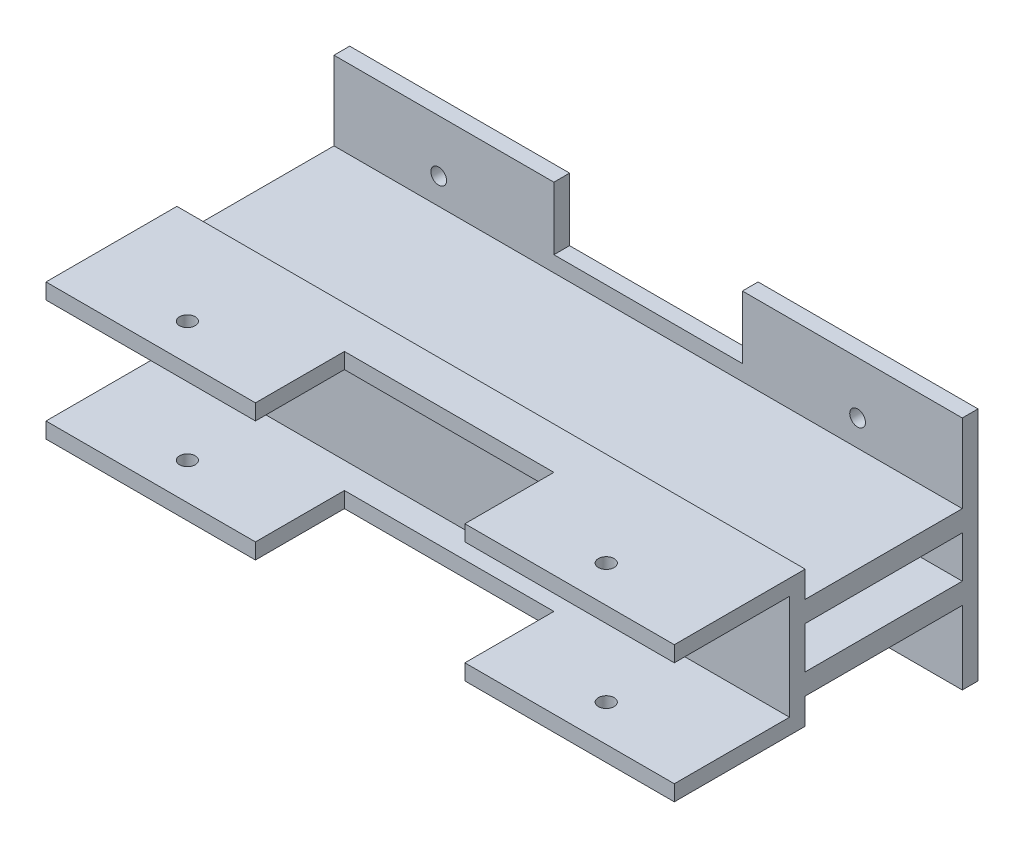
ISO-10303-21;
HEADER;
FILE_DESCRIPTION(('STEP AP214'),'2;1');
FILE_NAME('part.step','',(''),(''),'','','');
FILE_SCHEMA(('AUTOMOTIVE_DESIGN { 1 0 10303 214 1 1 1 1 }'));
ENDSEC;
DATA;
#1=APPLICATION_CONTEXT('core data for automotive mechanical design processes');
#2=APPLICATION_PROTOCOL_DEFINITION('international standard','automotive_design',2000,#1);
#3=PRODUCT_CONTEXT('',#1,'mechanical');
#4=PRODUCT('Part','Part','',(#3));
#5=PRODUCT_RELATED_PRODUCT_CATEGORY('part','',(#4));
#6=PRODUCT_DEFINITION_FORMATION('','',#4);
#7=PRODUCT_DEFINITION_CONTEXT('part definition',#1,'design');
#8=PRODUCT_DEFINITION('design','',#6,#7);
#9=PRODUCT_DEFINITION_SHAPE('','',#8);
#10=(LENGTH_UNIT() NAMED_UNIT(*) SI_UNIT(.MILLI.,.METRE.));
#11=(NAMED_UNIT(*) PLANE_ANGLE_UNIT() SI_UNIT($,.RADIAN.));
#12=(NAMED_UNIT(*) SI_UNIT($,.STERADIAN.) SOLID_ANGLE_UNIT());
#13=UNCERTAINTY_MEASURE_WITH_UNIT(LENGTH_MEASURE(1.E-05),#10,'distance_accuracy_value','');
#14=(GEOMETRIC_REPRESENTATION_CONTEXT(3) GLOBAL_UNCERTAINTY_ASSIGNED_CONTEXT((#13)) GLOBAL_UNIT_ASSIGNED_CONTEXT((#10,
#11,#12)) REPRESENTATION_CONTEXT('',''));
#15=CARTESIAN_POINT('',(0.,0.,0.));
#16=DIRECTION('',(0.,0.,1.));
#17=DIRECTION('',(1.,0.,0.));
#18=AXIS2_PLACEMENT_3D('',#15,#16,#17);
#19=CARTESIAN_POINT('',(-100.,3.,-12.5));
#20=DIRECTION('',(0.,0.,1.));
#21=DIRECTION('',(1.,0.,0.));
#22=AXIS2_PLACEMENT_3D('',#19,#20,#21);
#23=PLANE('',#22);
#24=DIRECTION('',(0.,1.,0.));
#25=VECTOR('',#24,1.);
#26=CARTESIAN_POINT('',(20.,3.,-12.5));
#27=LINE('',#26,#25);
#28=CARTESIAN_POINT('',(20.,-14.,-12.5));
#29=VERTEX_POINT('',#28);
#30=CARTESIAN_POINT('',(20.,-6.,-12.5));
#31=VERTEX_POINT('',#30);
#32=EDGE_CURVE('E656',#29,#31,#27,.T.);
#33=ORIENTED_EDGE('',*,*,#32,.F.);
#34=DIRECTION('',(1.,0.,0.));
#35=VECTOR('',#34,1.);
#36=CARTESIAN_POINT('',(100.,-14.,-12.5));
#37=LINE('',#36,#35);
#38=CARTESIAN_POINT('',(-100.,-14.,-12.5));
#39=VERTEX_POINT('',#38);
#40=EDGE_CURVE('E321',#39,#29,#37,.T.);
#41=ORIENTED_EDGE('',*,*,#40,.F.);
#42=DIRECTION('',(0.,-1.,0.));
#43=VECTOR('',#42,1.);
#44=CARTESIAN_POINT('',(-100.,3.,-12.5));
#45=LINE('',#44,#43);
#46=CARTESIAN_POINT('',(-100.,-6.,-12.5));
#47=VERTEX_POINT('',#46);
#48=EDGE_CURVE('E415',#47,#39,#45,.T.);
#49=ORIENTED_EDGE('',*,*,#48,.F.);
#50=DIRECTION('',(-1.,0.,0.));
#51=VECTOR('',#50,1.);
#52=CARTESIAN_POINT('',(100.,-6.,-12.5));
#53=LINE('',#52,#51);
#54=EDGE_CURVE('E333',#31,#47,#53,.T.);
#55=ORIENTED_EDGE('',*,*,#54,.F.);
#56=EDGE_LOOP('',(#33,#41,#49,#55));
#57=FACE_BOUND('',#56,.T.);
#58=ADVANCED_FACE('F41',(#57),#23,.F.);
#59=DIRECTION('',(0.,1.,0.));
#60=VECTOR('',#59,1.);
#61=CARTESIAN_POINT('',(20.,3.,-12.5));
#62=LINE('',#61,#60);
#63=CARTESIAN_POINT('',(20.,-23.,-12.5));
#64=VERTEX_POINT('',#63);
#65=CARTESIAN_POINT('',(20.,-18.,-12.5));
#66=VERTEX_POINT('',#65);
#67=EDGE_CURVE('E677',#64,#66,#62,.T.);
#68=ORIENTED_EDGE('',*,*,#67,.F.);
#69=DIRECTION('',(1.,0.,0.));
#70=VECTOR('',#69,1.);
#71=CARTESIAN_POINT('',(-100.,-23.,-12.5));
#72=LINE('',#71,#70);
#73=CARTESIAN_POINT('',(-100.,-23.,-12.5));
#74=VERTEX_POINT('',#73);
#75=EDGE_CURVE('E372',#74,#64,#72,.T.);
#76=ORIENTED_EDGE('',*,*,#75,.F.);
#77=CARTESIAN_POINT('',(-100.,-18.,-12.5));
#78=VERTEX_POINT('',#77);
#79=EDGE_CURVE('E410',#78,#74,#45,.T.);
#80=ORIENTED_EDGE('',*,*,#79,.F.);
#81=DIRECTION('',(-1.,0.,0.));
#82=VECTOR('',#81,1.);
#83=CARTESIAN_POINT('',(100.,-18.,-12.5));
#84=LINE('',#83,#82);
#85=EDGE_CURVE('E319',#66,#78,#84,.T.);
#86=ORIENTED_EDGE('',*,*,#85,.F.);
#87=EDGE_LOOP('',(#68,#76,#80,#86));
#88=FACE_BOUND('',#87,.T.);
#89=ADVANCED_FACE('F598',(#88),#23,.F.);
#90=DIRECTION('',(0.,1.,0.));
#91=VECTOR('',#90,1.);
#92=CARTESIAN_POINT('',(20.,3.,-12.5));
#93=LINE('',#92,#91);
#94=CARTESIAN_POINT('',(20.,-2.,-12.5));
#95=VERTEX_POINT('',#94);
#96=CARTESIAN_POINT('',(20.,3.,-12.5));
#97=VERTEX_POINT('',#96);
#98=EDGE_CURVE('E619',#95,#97,#93,.T.);
#99=ORIENTED_EDGE('',*,*,#98,.F.);
#100=DIRECTION('',(1.,0.,0.));
#101=VECTOR('',#100,1.);
#102=CARTESIAN_POINT('',(100.,-2.,-12.5));
#103=LINE('',#102,#101);
#104=CARTESIAN_POINT('',(-100.,-2.,-12.5));
#105=VERTEX_POINT('',#104);
#106=EDGE_CURVE('E325',#105,#95,#103,.T.);
#107=ORIENTED_EDGE('',*,*,#106,.F.);
#108=CARTESIAN_POINT('',(-100.,3.,-12.5));
#109=VERTEX_POINT('',#108);
#110=EDGE_CURVE('E411',#109,#105,#45,.T.);
#111=ORIENTED_EDGE('',*,*,#110,.F.);
#112=DIRECTION('',(-1.,0.,0.));
#113=VECTOR('',#112,1.);
#114=CARTESIAN_POINT('',(-100.,3.,-12.5));
#115=LINE('',#114,#113);
#116=EDGE_CURVE('E394',#97,#109,#115,.T.);
#117=ORIENTED_EDGE('',*,*,#116,.F.);
#118=EDGE_LOOP('',(#99,#107,#111,#117));
#119=FACE_BOUND('',#118,.T.);
#120=ADVANCED_FACE('F600',(#119),#23,.F.);
#121=CARTESIAN_POINT('',(0.,3.,0.));
#122=DIRECTION('',(0.,-1.,0.));
#123=DIRECTION('',(0.,0.,-1.));
#124=AXIS2_PLACEMENT_3D('',#121,#122,#123);
#125=PLANE('',#124);
#126=CARTESIAN_POINT('',(0.,3.,5.5));
#127=DIRECTION('',(0.,1.,0.));
#128=DIRECTION('',(0.,0.,1.));
#129=AXIS2_PLACEMENT_3D('',#126,#127,#128);
#130=CIRCLE('',#129,1.5);
#131=CARTESIAN_POINT('',(0.,3.,7.));
#132=VERTEX_POINT('',#131);
#133=EDGE_CURVE('E349',#132,#132,#130,.T.);
#134=ORIENTED_EDGE('',*,*,#133,.F.);
#135=EDGE_LOOP('',(#134));
#136=FACE_BOUND('',#135,.T.);
#137=CARTESIAN_POINT('',(-80.,3.,5.5));
#138=DIRECTION('',(0.,1.,0.));
#139=DIRECTION('',(0.,0.,1.));
#140=AXIS2_PLACEMENT_3D('',#137,#138,#139);
#141=CIRCLE('',#140,1.5);
#142=CARTESIAN_POINT('',(-80.,3.,7.));
#143=VERTEX_POINT('',#142);
#144=EDGE_CURVE('E345',#143,#143,#141,.T.);
#145=ORIENTED_EDGE('',*,*,#144,.F.);
#146=EDGE_LOOP('',(#145));
#147=FACE_BOUND('',#146,.T.);
#148=DIRECTION('',(0.,0.,1.));
#149=VECTOR('',#148,1.);
#150=CARTESIAN_POINT('',(20.,3.,-4.5));
#151=LINE('',#150,#149);
#152=CARTESIAN_POINT('',(20.,3.,12.5));
#153=VERTEX_POINT('',#152);
#154=EDGE_CURVE('E514',#97,#153,#151,.T.);
#155=ORIENTED_EDGE('',*,*,#154,.F.);
#156=ORIENTED_EDGE('',*,*,#116,.T.);
#157=DIRECTION('',(0.,0.,1.));
#158=VECTOR('',#157,1.);
#159=CARTESIAN_POINT('',(-100.,3.,12.5));
#160=LINE('',#159,#158);
#161=CARTESIAN_POINT('',(-100.,3.,12.5));
#162=VERTEX_POINT('',#161);
#163=EDGE_CURVE('E396',#109,#162,#160,.T.);
#164=ORIENTED_EDGE('',*,*,#163,.T.);
#165=DIRECTION('',(1.,0.,0.));
#166=VECTOR('',#165,1.);
#167=CARTESIAN_POINT('',(-100.,3.,12.5));
#168=LINE('',#167,#166);
#169=CARTESIAN_POINT('',(-60.,3.,12.5));
#170=VERTEX_POINT('',#169);
#171=EDGE_CURVE('E400',#162,#170,#168,.T.);
#172=ORIENTED_EDGE('',*,*,#171,.T.);
#173=DIRECTION('',(0.,0.,1.));
#174=VECTOR('',#173,1.);
#175=CARTESIAN_POINT('',(-60.,3.,-4.5));
#176=LINE('',#175,#174);
#177=CARTESIAN_POINT('',(-60.,3.,-4.5));
#178=VERTEX_POINT('',#177);
#179=EDGE_CURVE('E505',#178,#170,#176,.T.);
#180=ORIENTED_EDGE('',*,*,#179,.F.);
#181=DIRECTION('',(-1.,0.,0.));
#182=VECTOR('',#181,1.);
#183=CARTESIAN_POINT('',(-60.,3.,-4.5));
#184=LINE('',#183,#182);
#185=CARTESIAN_POINT('',(-20.,3.,-4.5));
#186=VERTEX_POINT('',#185);
#187=EDGE_CURVE('E508',#186,#178,#184,.T.);
#188=ORIENTED_EDGE('',*,*,#187,.F.);
#189=DIRECTION('',(0.,0.,-1.));
#190=VECTOR('',#189,1.);
#191=CARTESIAN_POINT('',(-20.,3.,-4.5));
#192=LINE('',#191,#190);
#193=CARTESIAN_POINT('',(-20.,3.,12.5));
#194=VERTEX_POINT('',#193);
#195=EDGE_CURVE('E511',#194,#186,#192,.T.);
#196=ORIENTED_EDGE('',*,*,#195,.F.);
#197=EDGE_CURVE('E399',#194,#153,#168,.T.);
#198=ORIENTED_EDGE('',*,*,#197,.T.);
#199=EDGE_LOOP('',(#155,#156,#164,#172,#180,#188,#196,#198));
#200=FACE_BOUND('',#199,.T.);
#201=ADVANCED_FACE('F608',(#136,#147,#200),#125,.F.);
#202=CARTESIAN_POINT('',(0.,0.,0.));
#203=DIRECTION('',(0.,-1.,0.));
#204=DIRECTION('',(0.,0.,-1.));
#205=AXIS2_PLACEMENT_3D('',#202,#203,#204);
#206=PLANE('',#205);
#207=CARTESIAN_POINT('',(0.,0.,5.5));
#208=DIRECTION('',(0.,-1.,0.));
#209=DIRECTION('',(0.,0.,-1.));
#210=AXIS2_PLACEMENT_3D('',#207,#208,#209);
#211=CIRCLE('',#210,1.5);
#212=CARTESIAN_POINT('',(0.,0.,4.));
#213=VERTEX_POINT('',#212);
#214=EDGE_CURVE('E359',#213,#213,#211,.T.);
#215=ORIENTED_EDGE('',*,*,#214,.F.);
#216=EDGE_LOOP('',(#215));
#217=FACE_BOUND('',#216,.T.);
#218=CARTESIAN_POINT('',(-80.,0.,5.5));
#219=DIRECTION('',(0.,-1.,0.));
#220=DIRECTION('',(0.,0.,-1.));
#221=AXIS2_PLACEMENT_3D('',#218,#219,#220);
#222=CIRCLE('',#221,1.5);
#223=CARTESIAN_POINT('',(-80.,0.,4.));
#224=VERTEX_POINT('',#223);
#225=EDGE_CURVE('E365',#224,#224,#222,.T.);
#226=ORIENTED_EDGE('',*,*,#225,.F.);
#227=EDGE_LOOP('',(#226));
#228=FACE_BOUND('',#227,.T.);
#229=DIRECTION('',(-1.,0.,0.));
#230=VECTOR('',#229,1.);
#231=CARTESIAN_POINT('',(-100.,0.,-9.5));
#232=LINE('',#231,#230);
#233=CARTESIAN_POINT('',(20.,0.,-9.5));
#234=VERTEX_POINT('',#233);
#235=CARTESIAN_POINT('',(-100.,0.,-9.5));
#236=VERTEX_POINT('',#235);
#237=EDGE_CURVE('E386',#234,#236,#232,.T.);
#238=ORIENTED_EDGE('',*,*,#237,.F.);
#239=DIRECTION('',(0.,0.,-1.));
#240=VECTOR('',#239,1.);
#241=CARTESIAN_POINT('',(20.,0.,0.));
#242=LINE('',#241,#240);
#243=CARTESIAN_POINT('',(20.,0.,12.5));
#244=VERTEX_POINT('',#243);
#245=EDGE_CURVE('E547',#244,#234,#242,.T.);
#246=ORIENTED_EDGE('',*,*,#245,.F.);
#247=DIRECTION('',(1.,0.,0.));
#248=VECTOR('',#247,1.);
#249=CARTESIAN_POINT('',(-100.,0.,12.5));
#250=LINE('',#249,#248);
#251=CARTESIAN_POINT('',(-20.,0.,12.5));
#252=VERTEX_POINT('',#251);
#253=EDGE_CURVE('E405',#252,#244,#250,.T.);
#254=ORIENTED_EDGE('',*,*,#253,.F.);
#255=DIRECTION('',(0.,0.,1.));
#256=VECTOR('',#255,1.);
#257=CARTESIAN_POINT('',(-20.,0.,0.));
#258=LINE('',#257,#256);
#259=CARTESIAN_POINT('',(-20.,0.,-4.5));
#260=VERTEX_POINT('',#259);
#261=EDGE_CURVE('E562',#260,#252,#258,.T.);
#262=ORIENTED_EDGE('',*,*,#261,.F.);
#263=DIRECTION('',(1.,0.,0.));
#264=VECTOR('',#263,1.);
#265=CARTESIAN_POINT('',(0.,0.,-4.5));
#266=LINE('',#265,#264);
#267=CARTESIAN_POINT('',(-60.,0.,-4.5));
#268=VERTEX_POINT('',#267);
#269=EDGE_CURVE('E557',#268,#260,#266,.T.);
#270=ORIENTED_EDGE('',*,*,#269,.F.);
#271=DIRECTION('',(0.,0.,-1.));
#272=VECTOR('',#271,1.);
#273=CARTESIAN_POINT('',(-60.,0.,0.));
#274=LINE('',#273,#272);
#275=CARTESIAN_POINT('',(-60.,0.,12.5));
#276=VERTEX_POINT('',#275);
#277=EDGE_CURVE('E552',#276,#268,#274,.T.);
#278=ORIENTED_EDGE('',*,*,#277,.F.);
#279=CARTESIAN_POINT('',(-100.,0.,12.5));
#280=VERTEX_POINT('',#279);
#281=EDGE_CURVE('E397',#280,#276,#250,.T.);
#282=ORIENTED_EDGE('',*,*,#281,.F.);
#283=DIRECTION('',(0.,0.,1.));
#284=VECTOR('',#283,1.);
#285=CARTESIAN_POINT('',(-100.,0.,12.5));
#286=LINE('',#285,#284);
#287=EDGE_CURVE('E393',#236,#280,#286,.T.);
#288=ORIENTED_EDGE('',*,*,#287,.F.);
#289=EDGE_LOOP('',(#238,#246,#254,#262,#270,#278,#282,#288));
#290=FACE_BOUND('',#289,.T.);
#291=ADVANCED_FACE('F613',(#217,#228,#290),#206,.T.);
#292=CARTESIAN_POINT('',(-100.,-20.,-9.5));
#293=DIRECTION('',(0.,0.,-1.));
#294=DIRECTION('',(-1.,0.,0.));
#295=AXIS2_PLACEMENT_3D('',#292,#293,#294);
#296=PLANE('',#295);
#297=DIRECTION('',(0.,-1.,0.));
#298=VECTOR('',#297,1.);
#299=CARTESIAN_POINT('',(20.,-20.,-9.5));
#300=LINE('',#299,#298);
#301=CARTESIAN_POINT('',(20.,-20.,-9.5));
#302=VERTEX_POINT('',#301);
#303=EDGE_CURVE('E650',#234,#302,#300,.T.);
#304=ORIENTED_EDGE('',*,*,#303,.F.);
#305=ORIENTED_EDGE('',*,*,#237,.T.);
#306=DIRECTION('',(0.,1.,0.));
#307=VECTOR('',#306,1.);
#308=CARTESIAN_POINT('',(-100.,-20.,-9.5));
#309=LINE('',#308,#307);
#310=CARTESIAN_POINT('',(-100.,-20.,-9.5));
#311=VERTEX_POINT('',#310);
#312=EDGE_CURVE('E389',#311,#236,#309,.T.);
#313=ORIENTED_EDGE('',*,*,#312,.F.);
#314=DIRECTION('',(-1.,0.,0.));
#315=VECTOR('',#314,1.);
#316=CARTESIAN_POINT('',(-100.,-20.,-9.5));
#317=LINE('',#316,#315);
#318=EDGE_CURVE('E387',#302,#311,#317,.T.);
#319=ORIENTED_EDGE('',*,*,#318,.F.);
#320=EDGE_LOOP('',(#304,#305,#313,#319));
#321=FACE_BOUND('',#320,.T.);
#322=ADVANCED_FACE('F653',(#321),#296,.F.);
#323=CARTESIAN_POINT('',(0.,-20.,0.));
#324=DIRECTION('',(0.,-1.,0.));
#325=DIRECTION('',(0.,0.,-1.));
#326=AXIS2_PLACEMENT_3D('',#323,#324,#325);
#327=PLANE('',#326);
#328=CARTESIAN_POINT('',(0.,-20.,5.5));
#329=DIRECTION('',(0.,-1.,0.));
#330=DIRECTION('',(0.,0.,-1.));
#331=AXIS2_PLACEMENT_3D('',#328,#329,#330);
#332=CIRCLE('',#331,1.5);
#333=CARTESIAN_POINT('',(0.,-20.,4.));
#334=VERTEX_POINT('',#333);
#335=EDGE_CURVE('E352',#334,#334,#332,.T.);
#336=ORIENTED_EDGE('',*,*,#335,.T.);
#337=EDGE_LOOP('',(#336));
#338=FACE_BOUND('',#337,.T.);
#339=CARTESIAN_POINT('',(-80.,-20.,5.5));
#340=DIRECTION('',(0.,-1.,0.));
#341=DIRECTION('',(0.,0.,-1.));
#342=AXIS2_PLACEMENT_3D('',#339,#340,#341);
#343=CIRCLE('',#342,1.5);
#344=CARTESIAN_POINT('',(-80.,-20.,4.));
#345=VERTEX_POINT('',#344);
#346=EDGE_CURVE('E362',#345,#345,#343,.T.);
#347=ORIENTED_EDGE('',*,*,#346,.T.);
#348=EDGE_LOOP('',(#347));
#349=FACE_BOUND('',#348,.T.);
#350=DIRECTION('',(0.,0.,-1.));
#351=VECTOR('',#350,1.);
#352=CARTESIAN_POINT('',(20.,-20.,0.));
#353=LINE('',#352,#351);
#354=CARTESIAN_POINT('',(20.,-20.,12.5));
#355=VERTEX_POINT('',#354);
#356=EDGE_CURVE('E538',#355,#302,#353,.T.);
#357=ORIENTED_EDGE('',*,*,#356,.T.);
#358=ORIENTED_EDGE('',*,*,#318,.T.);
#359=DIRECTION('',(0.,0.,-1.));
#360=VECTOR('',#359,1.);
#361=CARTESIAN_POINT('',(-100.,-20.,12.5));
#362=LINE('',#361,#360);
#363=CARTESIAN_POINT('',(-100.,-20.,12.5));
#364=VERTEX_POINT('',#363);
#365=EDGE_CURVE('E368',#364,#311,#362,.T.);
#366=ORIENTED_EDGE('',*,*,#365,.F.);
#367=DIRECTION('',(-1.,0.,0.));
#368=VECTOR('',#367,1.);
#369=CARTESIAN_POINT('',(-100.,-20.,12.5));
#370=LINE('',#369,#368);
#371=CARTESIAN_POINT('',(-60.,-20.,12.5));
#372=VERTEX_POINT('',#371);
#373=EDGE_CURVE('E381',#372,#364,#370,.T.);
#374=ORIENTED_EDGE('',*,*,#373,.F.);
#375=DIRECTION('',(0.,0.,-1.));
#376=VECTOR('',#375,1.);
#377=CARTESIAN_POINT('',(-60.,-20.,0.));
#378=LINE('',#377,#376);
#379=CARTESIAN_POINT('',(-60.,-20.,-4.5));
#380=VERTEX_POINT('',#379);
#381=EDGE_CURVE('E549',#372,#380,#378,.T.);
#382=ORIENTED_EDGE('',*,*,#381,.T.);
#383=DIRECTION('',(1.,0.,0.));
#384=VECTOR('',#383,1.);
#385=CARTESIAN_POINT('',(0.,-20.,-4.5));
#386=LINE('',#385,#384);
#387=CARTESIAN_POINT('',(-20.,-20.,-4.5));
#388=VERTEX_POINT('',#387);
#389=EDGE_CURVE('E554',#380,#388,#386,.T.);
#390=ORIENTED_EDGE('',*,*,#389,.T.);
#391=DIRECTION('',(0.,0.,1.));
#392=VECTOR('',#391,1.);
#393=CARTESIAN_POINT('',(-20.,-20.,0.));
#394=LINE('',#393,#392);
#395=CARTESIAN_POINT('',(-20.,-20.,12.5));
#396=VERTEX_POINT('',#395);
#397=EDGE_CURVE('E559',#388,#396,#394,.T.);
#398=ORIENTED_EDGE('',*,*,#397,.T.);
#399=EDGE_CURVE('E373',#355,#396,#370,.T.);
#400=ORIENTED_EDGE('',*,*,#399,.F.);
#401=EDGE_LOOP('',(#357,#358,#366,#374,#382,#390,#398,#400));
#402=FACE_BOUND('',#401,.T.);
#403=ADVANCED_FACE('F710',(#338,#349,#402),#327,.F.);
#404=CARTESIAN_POINT('',(0.,-23.,0.));
#405=DIRECTION('',(0.,-1.,0.));
#406=DIRECTION('',(0.,0.,-1.));
#407=AXIS2_PLACEMENT_3D('',#404,#405,#406);
#408=PLANE('',#407);
#409=CARTESIAN_POINT('',(0.,-23.,5.5));
#410=DIRECTION('',(0.,-1.,0.));
#411=DIRECTION('',(0.,0.,-1.));
#412=AXIS2_PLACEMENT_3D('',#409,#410,#411);
#413=CIRCLE('',#412,1.5);
#414=CARTESIAN_POINT('',(0.,-23.,4.));
#415=VERTEX_POINT('',#414);
#416=EDGE_CURVE('E344',#415,#415,#413,.F.);
#417=ORIENTED_EDGE('',*,*,#416,.T.);
#418=EDGE_LOOP('',(#417));
#419=FACE_BOUND('',#418,.T.);
#420=CARTESIAN_POINT('',(-80.,-23.,5.5));
#421=DIRECTION('',(0.,-1.,0.));
#422=DIRECTION('',(0.,0.,-1.));
#423=AXIS2_PLACEMENT_3D('',#420,#421,#422);
#424=CIRCLE('',#423,1.5);
#425=CARTESIAN_POINT('',(-80.,-23.,4.));
#426=VERTEX_POINT('',#425);
#427=EDGE_CURVE('E348',#426,#426,#424,.F.);
#428=ORIENTED_EDGE('',*,*,#427,.T.);
#429=EDGE_LOOP('',(#428));
#430=FACE_BOUND('',#429,.T.);
#431=ORIENTED_EDGE('',*,*,#75,.T.);
#432=DIRECTION('',(0.,0.,1.));
#433=VECTOR('',#432,1.);
#434=CARTESIAN_POINT('',(20.,-23.,-4.5));
#435=LINE('',#434,#433);
#436=CARTESIAN_POINT('',(20.,-23.,12.5));
#437=VERTEX_POINT('',#436);
#438=EDGE_CURVE('E542',#64,#437,#435,.T.);
#439=ORIENTED_EDGE('',*,*,#438,.T.);
#440=DIRECTION('',(-1.,0.,0.));
#441=VECTOR('',#440,1.);
#442=CARTESIAN_POINT('',(-100.,-23.,12.5));
#443=LINE('',#442,#441);
#444=CARTESIAN_POINT('',(-20.,-23.,12.5));
#445=VERTEX_POINT('',#444);
#446=EDGE_CURVE('E378',#437,#445,#443,.T.);
#447=ORIENTED_EDGE('',*,*,#446,.T.);
#448=DIRECTION('',(0.,0.,-1.));
#449=VECTOR('',#448,1.);
#450=CARTESIAN_POINT('',(-20.,-23.,-4.5));
#451=LINE('',#450,#449);
#452=CARTESIAN_POINT('',(-20.,-23.,-4.5));
#453=VERTEX_POINT('',#452);
#454=EDGE_CURVE('E507',#445,#453,#451,.T.);
#455=ORIENTED_EDGE('',*,*,#454,.T.);
#456=DIRECTION('',(-1.,0.,0.));
#457=VECTOR('',#456,1.);
#458=CARTESIAN_POINT('',(-60.,-23.,-4.5));
#459=LINE('',#458,#457);
#460=CARTESIAN_POINT('',(-60.,-23.,-4.5));
#461=VERTEX_POINT('',#460);
#462=EDGE_CURVE('E523',#453,#461,#459,.T.);
#463=ORIENTED_EDGE('',*,*,#462,.T.);
#464=DIRECTION('',(0.,0.,1.));
#465=VECTOR('',#464,1.);
#466=CARTESIAN_POINT('',(-60.,-23.,-4.5));
#467=LINE('',#466,#465);
#468=CARTESIAN_POINT('',(-60.,-23.,12.5));
#469=VERTEX_POINT('',#468);
#470=EDGE_CURVE('E518',#461,#469,#467,.T.);
#471=ORIENTED_EDGE('',*,*,#470,.T.);
#472=CARTESIAN_POINT('',(-100.,-23.,12.5));
#473=VERTEX_POINT('',#472);
#474=EDGE_CURVE('E376',#469,#473,#443,.T.);
#475=ORIENTED_EDGE('',*,*,#474,.T.);
#476=DIRECTION('',(0.,0.,-1.));
#477=VECTOR('',#476,1.);
#478=CARTESIAN_POINT('',(-100.,-23.,12.5));
#479=LINE('',#478,#477);
#480=EDGE_CURVE('E369',#473,#74,#479,.T.);
#481=ORIENTED_EDGE('',*,*,#480,.T.);
#482=EDGE_LOOP('',(#431,#439,#447,#455,#463,#471,#475,#481));
#483=FACE_BOUND('',#482,.T.);
#484=ADVANCED_FACE('F702',(#419,#430,#483),#408,.T.);
#485=CARTESIAN_POINT('',(100.,-2.,-42.5));
#486=DIRECTION('',(0.,-1.,0.));
#487=DIRECTION('',(0.,0.,-1.));
#488=AXIS2_PLACEMENT_3D('',#485,#486,#487);
#489=PLANE('',#488);
#490=DIRECTION('',(0.,0.,1.));
#491=VECTOR('',#490,1.);
#492=CARTESIAN_POINT('',(20.,-2.,-42.5));
#493=LINE('',#492,#491);
#494=CARTESIAN_POINT('',(20.,-2.00000000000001,-42.5));
#495=VERTEX_POINT('',#494);
#496=EDGE_CURVE('E622',#495,#95,#493,.T.);
#497=ORIENTED_EDGE('',*,*,#496,.F.);
#498=DIRECTION('',(1.,0.,0.));
#499=VECTOR('',#498,1.);
#500=CARTESIAN_POINT('',(100.,-2.,-42.5));
#501=LINE('',#500,#499);
#502=CARTESIAN_POINT('',(-100.,-2.,-42.5));
#503=VERTEX_POINT('',#502);
#504=EDGE_CURVE('E329',#503,#495,#501,.T.);
#505=ORIENTED_EDGE('',*,*,#504,.F.);
#506=DIRECTION('',(0.,0.,1.));
#507=VECTOR('',#506,1.);
#508=CARTESIAN_POINT('',(-100.,-2.,-42.5));
#509=LINE('',#508,#507);
#510=EDGE_CURVE('E335',#503,#105,#509,.T.);
#511=ORIENTED_EDGE('',*,*,#510,.T.);
#512=ORIENTED_EDGE('',*,*,#106,.T.);
#513=EDGE_LOOP('',(#497,#505,#511,#512));
#514=FACE_BOUND('',#513,.T.);
#515=ADVANCED_FACE('F626',(#514),#489,.F.);
#516=CARTESIAN_POINT('',(100.,-6.,-42.5));
#517=DIRECTION('',(0.,1.,0.));
#518=DIRECTION('',(0.,0.,1.));
#519=AXIS2_PLACEMENT_3D('',#516,#517,#518);
#520=PLANE('',#519);
#521=DIRECTION('',(0.,0.,-1.));
#522=VECTOR('',#521,1.);
#523=CARTESIAN_POINT('',(20.,-6.,-42.5));
#524=LINE('',#523,#522);
#525=CARTESIAN_POINT('',(20.,-6.,-42.5));
#526=VERTEX_POINT('',#525);
#527=EDGE_CURVE('E55',#31,#526,#524,.T.);
#528=ORIENTED_EDGE('',*,*,#527,.F.);
#529=ORIENTED_EDGE('',*,*,#54,.T.);
#530=DIRECTION('',(0.,0.,1.));
#531=VECTOR('',#530,1.);
#532=CARTESIAN_POINT('',(-100.,-6.,-42.5));
#533=LINE('',#532,#531);
#534=CARTESIAN_POINT('',(-100.,-6.,-42.5));
#535=VERTEX_POINT('',#534);
#536=EDGE_CURVE('E341',#535,#47,#533,.T.);
#537=ORIENTED_EDGE('',*,*,#536,.F.);
#538=DIRECTION('',(-1.,0.,0.));
#539=VECTOR('',#538,1.);
#540=CARTESIAN_POINT('',(100.,-6.,-42.5));
#541=LINE('',#540,#539);
#542=EDGE_CURVE('E332',#526,#535,#541,.T.);
#543=ORIENTED_EDGE('',*,*,#542,.F.);
#544=EDGE_LOOP('',(#528,#529,#537,#543));
#545=FACE_BOUND('',#544,.T.);
#546=ADVANCED_FACE('F776',(#545),#520,.F.);
#547=CARTESIAN_POINT('',(100.,-14.,-42.5));
#548=DIRECTION('',(0.,-1.,0.));
#549=DIRECTION('',(0.,0.,-1.));
#550=AXIS2_PLACEMENT_3D('',#547,#548,#549);
#551=PLANE('',#550);
#552=DIRECTION('',(0.,0.,1.));
#553=VECTOR('',#552,1.);
#554=CARTESIAN_POINT('',(20.,-14.,-42.5));
#555=LINE('',#554,#553);
#556=CARTESIAN_POINT('',(20.,-14.,-42.5));
#557=VERTEX_POINT('',#556);
#558=EDGE_CURVE('E684',#557,#29,#555,.T.);
#559=ORIENTED_EDGE('',*,*,#558,.F.);
#560=DIRECTION('',(1.,0.,0.));
#561=VECTOR('',#560,1.);
#562=CARTESIAN_POINT('',(100.,-14.,-42.5));
#563=LINE('',#562,#561);
#564=CARTESIAN_POINT('',(-100.,-14.,-42.5));
#565=VERTEX_POINT('',#564);
#566=EDGE_CURVE('E322',#565,#557,#563,.T.);
#567=ORIENTED_EDGE('',*,*,#566,.F.);
#568=DIRECTION('',(0.,0.,1.));
#569=VECTOR('',#568,1.);
#570=CARTESIAN_POINT('',(-100.,-14.,-42.5));
#571=LINE('',#570,#569);
#572=EDGE_CURVE('E316',#565,#39,#571,.T.);
#573=ORIENTED_EDGE('',*,*,#572,.T.);
#574=ORIENTED_EDGE('',*,*,#40,.T.);
#575=EDGE_LOOP('',(#559,#567,#573,#574));
#576=FACE_BOUND('',#575,.T.);
#577=ADVANCED_FACE('F692',(#576),#551,.F.);
#578=CARTESIAN_POINT('',(100.,-18.,-42.5));
#579=DIRECTION('',(0.,1.,0.));
#580=DIRECTION('',(0.,0.,1.));
#581=AXIS2_PLACEMENT_3D('',#578,#579,#580);
#582=PLANE('',#581);
#583=DIRECTION('',(0.,0.,-1.));
#584=VECTOR('',#583,1.);
#585=CARTESIAN_POINT('',(20.,-18.,-42.5));
#586=LINE('',#585,#584);
#587=CARTESIAN_POINT('',(20.,-18.,-42.5));
#588=VERTEX_POINT('',#587);
#589=EDGE_CURVE('E279',#66,#588,#586,.T.);
#590=ORIENTED_EDGE('',*,*,#589,.F.);
#591=ORIENTED_EDGE('',*,*,#85,.T.);
#592=DIRECTION('',(0.,0.,1.));
#593=VECTOR('',#592,1.);
#594=CARTESIAN_POINT('',(-100.,-18.,-42.5));
#595=LINE('',#594,#593);
#596=CARTESIAN_POINT('',(-100.,-18.,-42.5));
#597=VERTEX_POINT('',#596);
#598=EDGE_CURVE('E313',#597,#78,#595,.T.);
#599=ORIENTED_EDGE('',*,*,#598,.F.);
#600=DIRECTION('',(-1.,0.,0.));
#601=VECTOR('',#600,1.);
#602=CARTESIAN_POINT('',(100.,-18.,-42.5));
#603=LINE('',#602,#601);
#604=EDGE_CURVE('E318',#588,#597,#603,.T.);
#605=ORIENTED_EDGE('',*,*,#604,.F.);
#606=EDGE_LOOP('',(#590,#591,#599,#605));
#607=FACE_BOUND('',#606,.T.);
#608=ADVANCED_FACE('F761',(#607),#582,.F.);
#609=CARTESIAN_POINT('',(0.,0.,-42.5));
#610=DIRECTION('',(0.,0.,1.));
#611=DIRECTION('',(1.,0.,0.));
#612=AXIS2_PLACEMENT_3D('',#609,#610,#611);
#613=PLANE('',#612);
#614=CARTESIAN_POINT('',(0.,3.,-42.5));
#615=DIRECTION('',(0.,0.,-1.));
#616=DIRECTION('',(-1.,0.,0.));
#617=AXIS2_PLACEMENT_3D('',#614,#615,#616);
#618=CIRCLE('',#617,1.5);
#619=CARTESIAN_POINT('',(-1.50000000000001,3.,-42.5));
#620=VERTEX_POINT('',#619);
#621=EDGE_CURVE('E448',#620,#620,#618,.T.);
#622=ORIENTED_EDGE('',*,*,#621,.T.);
#623=EDGE_LOOP('',(#622));
#624=FACE_BOUND('',#623,.T.);
#625=CARTESIAN_POINT('',(-80.,3.,-42.5));
#626=DIRECTION('',(0.,0.,-1.));
#627=DIRECTION('',(-1.,0.,0.));
#628=AXIS2_PLACEMENT_3D('',#625,#626,#627);
#629=CIRCLE('',#628,1.5);
#630=CARTESIAN_POINT('',(-81.5,3.,-42.5));
#631=VERTEX_POINT('',#630);
#632=EDGE_CURVE('E568',#631,#631,#629,.T.);
#633=ORIENTED_EDGE('',*,*,#632,.T.);
#634=EDGE_LOOP('',(#633));
#635=FACE_BOUND('',#634,.T.);
#636=ORIENTED_EDGE('',*,*,#504,.T.);
#637=DIRECTION('',(0.,1.,0.));
#638=VECTOR('',#637,1.);
#639=CARTESIAN_POINT('',(20.,0.,-42.5));
#640=LINE('',#639,#638);
#641=CARTESIAN_POINT('',(20.,13.,-42.5));
#642=VERTEX_POINT('',#641);
#643=EDGE_CURVE('E433',#495,#642,#640,.T.);
#644=ORIENTED_EDGE('',*,*,#643,.T.);
#645=DIRECTION('',(1.,0.,0.));
#646=VECTOR('',#645,1.);
#647=CARTESIAN_POINT('',(100.,13.,-42.5));
#648=LINE('',#647,#646);
#649=CARTESIAN_POINT('',(-22.,13.,-42.5));
#650=VERTEX_POINT('',#649);
#651=EDGE_CURVE('E425',#650,#642,#648,.T.);
#652=ORIENTED_EDGE('',*,*,#651,.F.);
#653=DIRECTION('',(0.,1.,0.));
#654=VECTOR('',#653,1.);
#655=CARTESIAN_POINT('',(-22.,0.,-42.5));
#656=LINE('',#655,#654);
#657=CARTESIAN_POINT('',(-22.,1.,-42.5));
#658=VERTEX_POINT('',#657);
#659=EDGE_CURVE('E63',#658,#650,#656,.T.);
#660=ORIENTED_EDGE('',*,*,#659,.F.);
#661=DIRECTION('',(1.,0.,0.));
#662=VECTOR('',#661,1.);
#663=CARTESIAN_POINT('',(0.,1.,-42.5));
#664=LINE('',#663,#662);
#665=CARTESIAN_POINT('',(-58.,1.,-42.5));
#666=VERTEX_POINT('',#665);
#667=EDGE_CURVE('E500',#666,#658,#664,.T.);
#668=ORIENTED_EDGE('',*,*,#667,.F.);
#669=DIRECTION('',(0.,-1.,0.));
#670=VECTOR('',#669,1.);
#671=CARTESIAN_POINT('',(-58.,0.,-42.5));
#672=LINE('',#671,#670);
#673=CARTESIAN_POINT('',(-58.,13.,-42.5));
#674=VERTEX_POINT('',#673);
#675=EDGE_CURVE('E498',#674,#666,#672,.T.);
#676=ORIENTED_EDGE('',*,*,#675,.F.);
#677=CARTESIAN_POINT('',(-100.,13.,-42.5));
#678=VERTEX_POINT('',#677);
#679=EDGE_CURVE('E303',#678,#674,#648,.T.);
#680=ORIENTED_EDGE('',*,*,#679,.F.);
#681=DIRECTION('',(0.,1.,0.));
#682=VECTOR('',#681,1.);
#683=CARTESIAN_POINT('',(-100.,-32.,-42.5));
#684=LINE('',#683,#682);
#685=EDGE_CURVE('E438',#503,#678,#684,.T.);
#686=ORIENTED_EDGE('',*,*,#685,.F.);
#687=EDGE_LOOP('',(#636,#644,#652,#660,#668,#676,#680,#686));
#688=FACE_BOUND('',#687,.T.);
#689=ADVANCED_FACE('F431',(#624,#635,#688),#613,.T.);
#690=ORIENTED_EDGE('',*,*,#566,.T.);
#691=DIRECTION('',(0.,1.,0.));
#692=VECTOR('',#691,1.);
#693=CARTESIAN_POINT('',(20.,0.,-42.5));
#694=LINE('',#693,#692);
#695=EDGE_CURVE('E621',#557,#526,#694,.T.);
#696=ORIENTED_EDGE('',*,*,#695,.T.);
#697=ORIENTED_EDGE('',*,*,#542,.T.);
#698=EDGE_CURVE('E437',#565,#535,#684,.T.);
#699=ORIENTED_EDGE('',*,*,#698,.F.);
#700=EDGE_LOOP('',(#690,#696,#697,#699));
#701=FACE_BOUND('',#700,.T.);
#702=ADVANCED_FACE('F750',(#701),#613,.T.);
#703=CARTESIAN_POINT('',(0.,-23.,-42.5));
#704=DIRECTION('',(0.,0.,-1.));
#705=DIRECTION('',(-1.,0.,0.));
#706=AXIS2_PLACEMENT_3D('',#703,#704,#705);
#707=CIRCLE('',#706,1.5);
#708=CARTESIAN_POINT('',(-1.50000000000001,-23.,-42.5));
#709=VERTEX_POINT('',#708);
#710=EDGE_CURVE('E456',#709,#709,#707,.T.);
#711=ORIENTED_EDGE('',*,*,#710,.T.);
#712=EDGE_LOOP('',(#711));
#713=FACE_BOUND('',#712,.T.);
#714=CARTESIAN_POINT('',(-80.,-23.,-42.5));
#715=DIRECTION('',(0.,0.,-1.));
#716=DIRECTION('',(-1.,0.,0.));
#717=AXIS2_PLACEMENT_3D('',#714,#715,#716);
#718=CIRCLE('',#717,1.5);
#719=CARTESIAN_POINT('',(-81.5,-23.,-42.5));
#720=VERTEX_POINT('',#719);
#721=EDGE_CURVE('E564',#720,#720,#718,.T.);
#722=ORIENTED_EDGE('',*,*,#721,.T.);
#723=EDGE_LOOP('',(#722));
#724=FACE_BOUND('',#723,.T.);
#725=DIRECTION('',(-1.,0.,0.));
#726=VECTOR('',#725,1.);
#727=CARTESIAN_POINT('',(100.,-32.,-42.5));
#728=LINE('',#727,#726);
#729=CARTESIAN_POINT('',(20.,-32.,-42.5));
#730=VERTEX_POINT('',#729);
#731=CARTESIAN_POINT('',(-22.,-32.,-42.5));
#732=VERTEX_POINT('',#731);
#733=EDGE_CURVE('E289',#730,#732,#728,.T.);
#734=ORIENTED_EDGE('',*,*,#733,.F.);
#735=DIRECTION('',(0.,1.,0.));
#736=VECTOR('',#735,1.);
#737=CARTESIAN_POINT('',(20.,0.,-42.5));
#738=LINE('',#737,#736);
#739=EDGE_CURVE('E273',#730,#588,#738,.T.);
#740=ORIENTED_EDGE('',*,*,#739,.T.);
#741=ORIENTED_EDGE('',*,*,#604,.T.);
#742=CARTESIAN_POINT('',(-100.,-32.,-42.5));
#743=VERTEX_POINT('',#742);
#744=EDGE_CURVE('E434',#743,#597,#684,.T.);
#745=ORIENTED_EDGE('',*,*,#744,.F.);
#746=CARTESIAN_POINT('',(-58.,-32.,-42.5));
#747=VERTEX_POINT('',#746);
#748=EDGE_CURVE('E298',#747,#743,#728,.T.);
#749=ORIENTED_EDGE('',*,*,#748,.F.);
#750=DIRECTION('',(0.,-1.,0.));
#751=VECTOR('',#750,1.);
#752=CARTESIAN_POINT('',(-58.,0.,-42.5));
#753=LINE('',#752,#751);
#754=CARTESIAN_POINT('',(-58.,-20.,-42.5));
#755=VERTEX_POINT('',#754);
#756=EDGE_CURVE('E494',#755,#747,#753,.T.);
#757=ORIENTED_EDGE('',*,*,#756,.F.);
#758=DIRECTION('',(-1.,0.,0.));
#759=VECTOR('',#758,1.);
#760=CARTESIAN_POINT('',(0.,-20.,-42.5));
#761=LINE('',#760,#759);
#762=CARTESIAN_POINT('',(-22.,-20.,-42.5));
#763=VERTEX_POINT('',#762);
#764=EDGE_CURVE('E502',#763,#755,#761,.T.);
#765=ORIENTED_EDGE('',*,*,#764,.F.);
#766=DIRECTION('',(0.,1.,0.));
#767=VECTOR('',#766,1.);
#768=CARTESIAN_POINT('',(-22.,0.,-42.5));
#769=LINE('',#768,#767);
#770=EDGE_CURVE('E296',#732,#763,#769,.T.);
#771=ORIENTED_EDGE('',*,*,#770,.F.);
#772=EDGE_LOOP('',(#734,#740,#741,#745,#749,#757,#765,#771));
#773=FACE_BOUND('',#772,.T.);
#774=ADVANCED_FACE('F294',(#713,#724,#773),#613,.T.);
#775=CARTESIAN_POINT('',(0.,0.,-45.5));
#776=DIRECTION('',(0.,0.,1.));
#777=DIRECTION('',(1.,0.,0.));
#778=AXIS2_PLACEMENT_3D('',#775,#776,#777);
#779=PLANE('',#778);
#780=CARTESIAN_POINT('',(-80.,-23.,-45.5));
#781=DIRECTION('',(0.,0.,-1.));
#782=DIRECTION('',(-1.,0.,0.));
#783=AXIS2_PLACEMENT_3D('',#780,#781,#782);
#784=CIRCLE('',#783,1.5);
#785=CARTESIAN_POINT('',(-81.5,-23.,-45.5));
#786=VERTEX_POINT('',#785);
#787=EDGE_CURVE('E565',#786,#786,#784,.T.);
#788=ORIENTED_EDGE('',*,*,#787,.F.);
#789=EDGE_LOOP('',(#788));
#790=FACE_BOUND('',#789,.T.);
#791=CARTESIAN_POINT('',(-80.,3.,-45.5));
#792=DIRECTION('',(0.,0.,-1.));
#793=DIRECTION('',(-1.,0.,0.));
#794=AXIS2_PLACEMENT_3D('',#791,#792,#793);
#795=CIRCLE('',#794,1.5);
#796=CARTESIAN_POINT('',(-81.5,3.,-45.5));
#797=VERTEX_POINT('',#796);
#798=EDGE_CURVE('E571',#797,#797,#795,.T.);
#799=ORIENTED_EDGE('',*,*,#798,.F.);
#800=EDGE_LOOP('',(#799));
#801=FACE_BOUND('',#800,.T.);
#802=CARTESIAN_POINT('',(0.,-23.,-45.5));
#803=DIRECTION('',(0.,0.,-1.));
#804=DIRECTION('',(-1.,0.,0.));
#805=AXIS2_PLACEMENT_3D('',#802,#803,#804);
#806=CIRCLE('',#805,1.5);
#807=CARTESIAN_POINT('',(-1.50000000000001,-23.,-45.5));
#808=VERTEX_POINT('',#807);
#809=EDGE_CURVE('E453',#808,#808,#806,.T.);
#810=ORIENTED_EDGE('',*,*,#809,.F.);
#811=EDGE_LOOP('',(#810));
#812=FACE_BOUND('',#811,.T.);
#813=CARTESIAN_POINT('',(0.,3.,-45.5));
#814=DIRECTION('',(0.,0.,-1.));
#815=DIRECTION('',(-1.,0.,0.));
#816=AXIS2_PLACEMENT_3D('',#813,#814,#815);
#817=CIRCLE('',#816,1.5);
#818=CARTESIAN_POINT('',(-1.50000000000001,3.,-45.5));
#819=VERTEX_POINT('',#818);
#820=EDGE_CURVE('E443',#819,#819,#817,.T.);
#821=ORIENTED_EDGE('',*,*,#820,.F.);
#822=EDGE_LOOP('',(#821));
#823=FACE_BOUND('',#822,.T.);
#824=DIRECTION('',(0.,1.,0.));
#825=VECTOR('',#824,1.);
#826=CARTESIAN_POINT('',(20.,0.,-45.5));
#827=LINE('',#826,#825);
#828=CARTESIAN_POINT('',(20.,-32.,-45.5));
#829=VERTEX_POINT('',#828);
#830=CARTESIAN_POINT('',(20.,13.,-45.5));
#831=VERTEX_POINT('',#830);
#832=EDGE_CURVE('E283',#829,#831,#827,.T.);
#833=ORIENTED_EDGE('',*,*,#832,.F.);
#834=DIRECTION('',(-1.,0.,0.));
#835=VECTOR('',#834,1.);
#836=CARTESIAN_POINT('',(100.,-32.,-45.5));
#837=LINE('',#836,#835);
#838=CARTESIAN_POINT('',(-22.,-32.,-45.5));
#839=VERTEX_POINT('',#838);
#840=EDGE_CURVE('E291',#829,#839,#837,.T.);
#841=ORIENTED_EDGE('',*,*,#840,.T.);
#842=DIRECTION('',(0.,-1.,0.));
#843=VECTOR('',#842,1.);
#844=CARTESIAN_POINT('',(-22.,-20.,-45.5));
#845=LINE('',#844,#843);
#846=CARTESIAN_POINT('',(-22.,-20.,-45.5));
#847=VERTEX_POINT('',#846);
#848=EDGE_CURVE('E665',#847,#839,#845,.T.);
#849=ORIENTED_EDGE('',*,*,#848,.F.);
#850=DIRECTION('',(1.,0.,0.));
#851=VECTOR('',#850,1.);
#852=CARTESIAN_POINT('',(-40.,-20.,-45.5));
#853=LINE('',#852,#851);
#854=CARTESIAN_POINT('',(-58.,-20.,-45.5));
#855=VERTEX_POINT('',#854);
#856=EDGE_CURVE('E488',#855,#847,#853,.T.);
#857=ORIENTED_EDGE('',*,*,#856,.F.);
#858=DIRECTION('',(0.,1.,0.));
#859=VECTOR('',#858,1.);
#860=CARTESIAN_POINT('',(-58.,-32.,-45.5));
#861=LINE('',#860,#859);
#862=CARTESIAN_POINT('',(-58.,-32.,-45.5));
#863=VERTEX_POINT('',#862);
#864=EDGE_CURVE('E472',#863,#855,#861,.T.);
#865=ORIENTED_EDGE('',*,*,#864,.F.);
#866=CARTESIAN_POINT('',(-100.,-32.,-45.5));
#867=VERTEX_POINT('',#866);
#868=EDGE_CURVE('E461',#863,#867,#837,.T.);
#869=ORIENTED_EDGE('',*,*,#868,.T.);
#870=DIRECTION('',(0.,1.,0.));
#871=VECTOR('',#870,1.);
#872=CARTESIAN_POINT('',(-100.,-32.,-45.5));
#873=LINE('',#872,#871);
#874=CARTESIAN_POINT('',(-100.,13.,-45.5));
#875=VERTEX_POINT('',#874);
#876=EDGE_CURVE('E297',#867,#875,#873,.T.);
#877=ORIENTED_EDGE('',*,*,#876,.T.);
#878=DIRECTION('',(1.,0.,0.));
#879=VECTOR('',#878,1.);
#880=CARTESIAN_POINT('',(100.,13.,-45.5));
#881=LINE('',#880,#879);
#882=CARTESIAN_POINT('',(-58.,13.,-45.5));
#883=VERTEX_POINT('',#882);
#884=EDGE_CURVE('E459',#875,#883,#881,.T.);
#885=ORIENTED_EDGE('',*,*,#884,.T.);
#886=DIRECTION('',(0.,1.,0.));
#887=VECTOR('',#886,1.);
#888=CARTESIAN_POINT('',(-58.,1.,-45.5));
#889=LINE('',#888,#887);
#890=CARTESIAN_POINT('',(-58.,1.,-45.5));
#891=VERTEX_POINT('',#890);
#892=EDGE_CURVE('E482',#891,#883,#889,.T.);
#893=ORIENTED_EDGE('',*,*,#892,.F.);
#894=DIRECTION('',(-1.,0.,0.));
#895=VECTOR('',#894,1.);
#896=CARTESIAN_POINT('',(-22.,1.,-45.5));
#897=LINE('',#896,#895);
#898=CARTESIAN_POINT('',(-22.,1.,-45.5));
#899=VERTEX_POINT('',#898);
#900=EDGE_CURVE('E484',#899,#891,#897,.T.);
#901=ORIENTED_EDGE('',*,*,#900,.F.);
#902=DIRECTION('',(0.,-1.,0.));
#903=VECTOR('',#902,1.);
#904=CARTESIAN_POINT('',(-22.,13.,-45.5));
#905=LINE('',#904,#903);
#906=CARTESIAN_POINT('',(-22.,13.,-45.5));
#907=VERTEX_POINT('',#906);
#908=EDGE_CURVE('E486',#907,#899,#905,.T.);
#909=ORIENTED_EDGE('',*,*,#908,.F.);
#910=EDGE_CURVE('E301',#907,#831,#881,.T.);
#911=ORIENTED_EDGE('',*,*,#910,.T.);
#912=EDGE_LOOP('',(#833,#841,#849,#857,#865,#869,#877,#885,#893,#901,#909,#911));
#913=FACE_BOUND('',#912,.T.);
#914=ADVANCED_FACE('F468',(#790,#801,#812,#823,#913),#779,.F.);
#915=CARTESIAN_POINT('',(100.,13.,-45.5));
#916=DIRECTION('',(0.,-1.,0.));
#917=DIRECTION('',(0.,0.,-1.));
#918=AXIS2_PLACEMENT_3D('',#915,#916,#917);
#919=PLANE('',#918);
#920=DIRECTION('',(0.,0.,1.));
#921=VECTOR('',#920,1.);
#922=CARTESIAN_POINT('',(20.,13.,-45.5));
#923=LINE('',#922,#921);
#924=EDGE_CURVE('E679',#831,#642,#923,.T.);
#925=ORIENTED_EDGE('',*,*,#924,.F.);
#926=ORIENTED_EDGE('',*,*,#910,.F.);
#927=DIRECTION('',(0.,0.,1.));
#928=VECTOR('',#927,1.);
#929=CARTESIAN_POINT('',(-22.,13.,-45.5));
#930=LINE('',#929,#928);
#931=EDGE_CURVE('E48',#907,#650,#930,.T.);
#932=ORIENTED_EDGE('',*,*,#931,.T.);
#933=ORIENTED_EDGE('',*,*,#651,.T.);
#934=EDGE_LOOP('',(#925,#926,#932,#933));
#935=FACE_BOUND('',#934,.T.);
#936=ADVANCED_FACE('F424',(#935),#919,.F.);
#937=CARTESIAN_POINT('',(100.,-32.,-45.5));
#938=DIRECTION('',(0.,1.,0.));
#939=DIRECTION('',(0.,0.,1.));
#940=AXIS2_PLACEMENT_3D('',#937,#938,#939);
#941=PLANE('',#940);
#942=DIRECTION('',(0.,0.,-1.));
#943=VECTOR('',#942,1.);
#944=CARTESIAN_POINT('',(20.,-32.,-45.5));
#945=LINE('',#944,#943);
#946=EDGE_CURVE('E276',#730,#829,#945,.T.);
#947=ORIENTED_EDGE('',*,*,#946,.F.);
#948=ORIENTED_EDGE('',*,*,#733,.T.);
#949=DIRECTION('',(0.,0.,-1.));
#950=VECTOR('',#949,1.);
#951=CARTESIAN_POINT('',(-22.,-32.,-45.5));
#952=LINE('',#951,#950);
#953=EDGE_CURVE('E414',#732,#839,#952,.T.);
#954=ORIENTED_EDGE('',*,*,#953,.T.);
#955=ORIENTED_EDGE('',*,*,#840,.F.);
#956=EDGE_LOOP('',(#947,#948,#954,#955));
#957=FACE_BOUND('',#956,.T.);
#958=ADVANCED_FACE('F287',(#957),#941,.F.);
#959=ORIENTED_EDGE('',*,*,#679,.T.);
#960=DIRECTION('',(0.,0.,-1.));
#961=VECTOR('',#960,1.);
#962=CARTESIAN_POINT('',(-58.,13.,-45.5));
#963=LINE('',#962,#961);
#964=EDGE_CURVE('E11',#674,#883,#963,.T.);
#965=ORIENTED_EDGE('',*,*,#964,.T.);
#966=ORIENTED_EDGE('',*,*,#884,.F.);
#967=DIRECTION('',(0.,0.,1.));
#968=VECTOR('',#967,1.);
#969=CARTESIAN_POINT('',(-100.,13.,-45.5));
#970=LINE('',#969,#968);
#971=EDGE_CURVE('E310',#875,#678,#970,.T.);
#972=ORIENTED_EDGE('',*,*,#971,.T.);
#973=EDGE_LOOP('',(#959,#965,#966,#972));
#974=FACE_BOUND('',#973,.T.);
#975=ADVANCED_FACE('F479',(#974),#919,.F.);
#976=ORIENTED_EDGE('',*,*,#868,.F.);
#977=DIRECTION('',(0.,0.,1.));
#978=VECTOR('',#977,1.);
#979=CARTESIAN_POINT('',(-58.,-32.,-45.5));
#980=LINE('',#979,#978);
#981=EDGE_CURVE('E417',#863,#747,#980,.T.);
#982=ORIENTED_EDGE('',*,*,#981,.T.);
#983=ORIENTED_EDGE('',*,*,#748,.T.);
#984=DIRECTION('',(0.,0.,1.));
#985=VECTOR('',#984,1.);
#986=CARTESIAN_POINT('',(-100.,-32.,-45.5));
#987=LINE('',#986,#985);
#988=EDGE_CURVE('E307',#867,#743,#987,.T.);
#989=ORIENTED_EDGE('',*,*,#988,.F.);
#990=EDGE_LOOP('',(#976,#982,#983,#989));
#991=FACE_BOUND('',#990,.T.);
#992=ADVANCED_FACE('F474',(#991),#941,.F.);
#993=CARTESIAN_POINT('',(-100.,3.,12.5));
#994=DIRECTION('',(0.,0.,-1.));
#995=DIRECTION('',(-1.,0.,0.));
#996=AXIS2_PLACEMENT_3D('',#993,#994,#995);
#997=PLANE('',#996);
#998=ORIENTED_EDGE('',*,*,#197,.F.);
#999=DIRECTION('',(0.,1.,0.));
#1000=VECTOR('',#999,1.);
#1001=CARTESIAN_POINT('',(-20.,-66.4626276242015,12.5));
#1002=LINE('',#1001,#1000);
#1003=EDGE_CURVE('E531',#252,#194,#1002,.T.);
#1004=ORIENTED_EDGE('',*,*,#1003,.F.);
#1005=ORIENTED_EDGE('',*,*,#253,.T.);
#1006=DIRECTION('',(0.,1.,0.));
#1007=VECTOR('',#1006,1.);
#1008=CARTESIAN_POINT('',(20.,-66.4626276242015,12.5));
#1009=LINE('',#1008,#1007);
#1010=EDGE_CURVE('E504',#244,#153,#1009,.T.);
#1011=ORIENTED_EDGE('',*,*,#1010,.T.);
#1012=EDGE_LOOP('',(#998,#1004,#1005,#1011));
#1013=FACE_BOUND('',#1012,.T.);
#1014=ADVANCED_FACE('F640',(#1013),#997,.F.);
#1015=ORIENTED_EDGE('',*,*,#281,.T.);
#1016=DIRECTION('',(0.,1.,0.));
#1017=VECTOR('',#1016,1.);
#1018=CARTESIAN_POINT('',(-60.,-66.4626276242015,12.5));
#1019=LINE('',#1018,#1017);
#1020=EDGE_CURVE('E521',#276,#170,#1019,.T.);
#1021=ORIENTED_EDGE('',*,*,#1020,.T.);
#1022=ORIENTED_EDGE('',*,*,#171,.F.);
#1023=DIRECTION('',(0.,-1.,0.));
#1024=VECTOR('',#1023,1.);
#1025=CARTESIAN_POINT('',(-100.,3.,12.5));
#1026=LINE('',#1025,#1024);
#1027=EDGE_CURVE('E403',#162,#280,#1026,.T.);
#1028=ORIENTED_EDGE('',*,*,#1027,.T.);
#1029=EDGE_LOOP('',(#1015,#1021,#1022,#1028));
#1030=FACE_BOUND('',#1029,.T.);
#1031=ADVANCED_FACE('F714',(#1030),#997,.F.);
#1032=CARTESIAN_POINT('',(-100.,-23.,12.5));
#1033=DIRECTION('',(0.,0.,-1.));
#1034=DIRECTION('',(-1.,0.,0.));
#1035=AXIS2_PLACEMENT_3D('',#1032,#1033,#1034);
#1036=PLANE('',#1035);
#1037=ORIENTED_EDGE('',*,*,#399,.T.);
#1038=EDGE_CURVE('E536',#445,#396,#1002,.T.);
#1039=ORIENTED_EDGE('',*,*,#1038,.F.);
#1040=ORIENTED_EDGE('',*,*,#446,.F.);
#1041=EDGE_CURVE('E539',#437,#355,#1009,.T.);
#1042=ORIENTED_EDGE('',*,*,#1041,.T.);
#1043=EDGE_LOOP('',(#1037,#1039,#1040,#1042));
#1044=FACE_BOUND('',#1043,.T.);
#1045=ADVANCED_FACE('F800',(#1044),#1036,.F.);
#1046=ORIENTED_EDGE('',*,*,#474,.F.);
#1047=EDGE_CURVE('E528',#469,#372,#1019,.T.);
#1048=ORIENTED_EDGE('',*,*,#1047,.T.);
#1049=ORIENTED_EDGE('',*,*,#373,.T.);
#1050=DIRECTION('',(0.,1.,0.));
#1051=VECTOR('',#1050,1.);
#1052=CARTESIAN_POINT('',(-100.,-23.,12.5));
#1053=LINE('',#1052,#1051);
#1054=EDGE_CURVE('E383',#473,#364,#1053,.T.);
#1055=ORIENTED_EDGE('',*,*,#1054,.F.);
#1056=EDGE_LOOP('',(#1046,#1048,#1049,#1055));
#1057=FACE_BOUND('',#1056,.T.);
#1058=ADVANCED_FACE('F706',(#1057),#1036,.F.);
#1059=CARTESIAN_POINT('',(-100.,3.,12.5));
#1060=DIRECTION('',(1.,0.,0.));
#1061=DIRECTION('',(0.,0.,-1.));
#1062=AXIS2_PLACEMENT_3D('',#1059,#1060,#1061);
#1063=PLANE('',#1062);
#1064=ORIENTED_EDGE('',*,*,#510,.F.);
#1065=ORIENTED_EDGE('',*,*,#685,.T.);
#1066=ORIENTED_EDGE('',*,*,#971,.F.);
#1067=ORIENTED_EDGE('',*,*,#876,.F.);
#1068=ORIENTED_EDGE('',*,*,#988,.T.);
#1069=ORIENTED_EDGE('',*,*,#744,.T.);
#1070=ORIENTED_EDGE('',*,*,#598,.T.);
#1071=ORIENTED_EDGE('',*,*,#79,.T.);
#1072=ORIENTED_EDGE('',*,*,#480,.F.);
#1073=ORIENTED_EDGE('',*,*,#1054,.T.);
#1074=ORIENTED_EDGE('',*,*,#365,.T.);
#1075=ORIENTED_EDGE('',*,*,#312,.T.);
#1076=ORIENTED_EDGE('',*,*,#287,.T.);
#1077=ORIENTED_EDGE('',*,*,#1027,.F.);
#1078=ORIENTED_EDGE('',*,*,#163,.F.);
#1079=ORIENTED_EDGE('',*,*,#110,.T.);
#1080=EDGE_LOOP('',(#1064,#1065,#1066,#1067,#1068,#1069,#1070,#1071,#1072,#1073,#1074,#1075,
#1076,#1077,#1078,#1079));
#1081=FACE_BOUND('',#1080,.T.);
#1082=ORIENTED_EDGE('',*,*,#698,.T.);
#1083=ORIENTED_EDGE('',*,*,#536,.T.);
#1084=ORIENTED_EDGE('',*,*,#48,.T.);
#1085=ORIENTED_EDGE('',*,*,#572,.F.);
#1086=EDGE_LOOP('',(#1082,#1083,#1084,#1085));
#1087=FACE_BOUND('',#1086,.T.);
#1088=ADVANCED_FACE('F476',(#1081,#1087),#1063,.F.);
#1089=CARTESIAN_POINT('',(0.,-27.2426406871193,5.5));
#1090=DIRECTION('',(0.,1.,0.));
#1091=DIRECTION('',(0.,0.,1.));
#1092=AXIS2_PLACEMENT_3D('',#1089,#1090,#1091);
#1093=CYLINDRICAL_SURFACE('',#1092,1.5);
#1094=ORIENTED_EDGE('',*,*,#416,.F.);
#1095=EDGE_LOOP('',(#1094));
#1096=FACE_BOUND('',#1095,.T.);
#1097=ORIENTED_EDGE('',*,*,#335,.F.);
#1098=EDGE_LOOP('',(#1097));
#1099=FACE_BOUND('',#1098,.T.);
#1100=ADVANCED_FACE('F793',(#1096,#1099),#1093,.F.);
#1101=CARTESIAN_POINT('',(-80.,-27.2426406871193,5.5));
#1102=DIRECTION('',(0.,1.,0.));
#1103=DIRECTION('',(0.,0.,1.));
#1104=AXIS2_PLACEMENT_3D('',#1101,#1102,#1103);
#1105=CYLINDRICAL_SURFACE('',#1104,1.5);
#1106=ORIENTED_EDGE('',*,*,#427,.F.);
#1107=EDGE_LOOP('',(#1106));
#1108=FACE_BOUND('',#1107,.T.);
#1109=ORIENTED_EDGE('',*,*,#346,.F.);
#1110=EDGE_LOOP('',(#1109));
#1111=FACE_BOUND('',#1110,.T.);
#1112=ADVANCED_FACE('F789',(#1108,#1111),#1105,.F.);
#1113=ORIENTED_EDGE('',*,*,#214,.T.);
#1114=EDGE_LOOP('',(#1113));
#1115=FACE_BOUND('',#1114,.T.);
#1116=ORIENTED_EDGE('',*,*,#133,.T.);
#1117=EDGE_LOOP('',(#1116));
#1118=FACE_BOUND('',#1117,.T.);
#1119=ADVANCED_FACE('F787',(#1115,#1118),#1093,.F.);
#1120=ORIENTED_EDGE('',*,*,#225,.T.);
#1121=EDGE_LOOP('',(#1120));
#1122=FACE_BOUND('',#1121,.T.);
#1123=ORIENTED_EDGE('',*,*,#144,.T.);
#1124=EDGE_LOOP('',(#1123));
#1125=FACE_BOUND('',#1124,.T.);
#1126=ADVANCED_FACE('F595',(#1122,#1125),#1105,.F.);
#1127=CARTESIAN_POINT('',(0.,3.,-45.5));
#1128=DIRECTION('',(0.,0.,1.));
#1129=DIRECTION('',(1.,0.,0.));
#1130=AXIS2_PLACEMENT_3D('',#1127,#1128,#1129);
#1131=CYLINDRICAL_SURFACE('',#1130,1.5);
#1132=ORIENTED_EDGE('',*,*,#820,.T.);
#1133=EDGE_LOOP('',(#1132));
#1134=FACE_BOUND('',#1133,.T.);
#1135=ORIENTED_EDGE('',*,*,#621,.F.);
#1136=EDGE_LOOP('',(#1135));
#1137=FACE_BOUND('',#1136,.T.);
#1138=ADVANCED_FACE('F586',(#1134,#1137),#1131,.F.);
#1139=CARTESIAN_POINT('',(0.,-23.,-45.5));
#1140=DIRECTION('',(0.,0.,1.));
#1141=DIRECTION('',(1.,0.,0.));
#1142=AXIS2_PLACEMENT_3D('',#1139,#1140,#1141);
#1143=CYLINDRICAL_SURFACE('',#1142,1.5);
#1144=ORIENTED_EDGE('',*,*,#809,.T.);
#1145=EDGE_LOOP('',(#1144));
#1146=FACE_BOUND('',#1145,.T.);
#1147=ORIENTED_EDGE('',*,*,#710,.F.);
#1148=EDGE_LOOP('',(#1147));
#1149=FACE_BOUND('',#1148,.T.);
#1150=ADVANCED_FACE('F583',(#1146,#1149),#1143,.F.);
#1151=CARTESIAN_POINT('',(-80.,3.,-45.5));
#1152=DIRECTION('',(0.,0.,1.));
#1153=DIRECTION('',(1.,0.,0.));
#1154=AXIS2_PLACEMENT_3D('',#1151,#1152,#1153);
#1155=CYLINDRICAL_SURFACE('',#1154,1.5);
#1156=ORIENTED_EDGE('',*,*,#798,.T.);
#1157=EDGE_LOOP('',(#1156));
#1158=FACE_BOUND('',#1157,.T.);
#1159=ORIENTED_EDGE('',*,*,#632,.F.);
#1160=EDGE_LOOP('',(#1159));
#1161=FACE_BOUND('',#1160,.T.);
#1162=ADVANCED_FACE('F585',(#1158,#1161),#1155,.F.);
#1163=CARTESIAN_POINT('',(-80.,-23.,-45.5));
#1164=DIRECTION('',(0.,0.,1.));
#1165=DIRECTION('',(1.,0.,0.));
#1166=AXIS2_PLACEMENT_3D('',#1163,#1164,#1165);
#1167=CYLINDRICAL_SURFACE('',#1166,1.5);
#1168=ORIENTED_EDGE('',*,*,#787,.T.);
#1169=EDGE_LOOP('',(#1168));
#1170=FACE_BOUND('',#1169,.T.);
#1171=ORIENTED_EDGE('',*,*,#721,.F.);
#1172=EDGE_LOOP('',(#1171));
#1173=FACE_BOUND('',#1172,.T.);
#1174=ADVANCED_FACE('F592',(#1170,#1173),#1167,.F.);
#1175=CARTESIAN_POINT('',(20.,-66.4626276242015,-4.5));
#1176=DIRECTION('',(-1.,0.,0.));
#1177=DIRECTION('',(0.,0.,1.));
#1178=AXIS2_PLACEMENT_3D('',#1175,#1176,#1177);
#1179=PLANE('',#1178);
#1180=ORIENTED_EDGE('',*,*,#1041,.F.);
#1181=ORIENTED_EDGE('',*,*,#438,.F.);
#1182=ORIENTED_EDGE('',*,*,#67,.T.);
#1183=ORIENTED_EDGE('',*,*,#589,.T.);
#1184=ORIENTED_EDGE('',*,*,#739,.F.);
#1185=ORIENTED_EDGE('',*,*,#946,.T.);
#1186=ORIENTED_EDGE('',*,*,#832,.T.);
#1187=ORIENTED_EDGE('',*,*,#924,.T.);
#1188=ORIENTED_EDGE('',*,*,#643,.F.);
#1189=ORIENTED_EDGE('',*,*,#496,.T.);
#1190=ORIENTED_EDGE('',*,*,#98,.T.);
#1191=ORIENTED_EDGE('',*,*,#154,.T.);
#1192=ORIENTED_EDGE('',*,*,#1010,.F.);
#1193=ORIENTED_EDGE('',*,*,#245,.T.);
#1194=ORIENTED_EDGE('',*,*,#303,.T.);
#1195=ORIENTED_EDGE('',*,*,#356,.F.);
#1196=EDGE_LOOP('',(#1180,#1181,#1182,#1183,#1184,#1185,#1186,#1187,#1188,#1189,#1190,#1191,
#1192,#1193,#1194,#1195));
#1197=FACE_BOUND('',#1196,.T.);
#1198=ORIENTED_EDGE('',*,*,#32,.T.);
#1199=ORIENTED_EDGE('',*,*,#527,.T.);
#1200=ORIENTED_EDGE('',*,*,#695,.F.);
#1201=ORIENTED_EDGE('',*,*,#558,.T.);
#1202=EDGE_LOOP('',(#1198,#1199,#1200,#1201));
#1203=FACE_BOUND('',#1202,.T.);
#1204=ADVANCED_FACE('F275',(#1197,#1203),#1179,.F.);
#1205=CARTESIAN_POINT('',(-60.,-66.4626276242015,-4.5));
#1206=DIRECTION('',(-1.,0.,0.));
#1207=DIRECTION('',(0.,0.,1.));
#1208=AXIS2_PLACEMENT_3D('',#1205,#1206,#1207);
#1209=PLANE('',#1208);
#1210=ORIENTED_EDGE('',*,*,#1047,.F.);
#1211=ORIENTED_EDGE('',*,*,#470,.F.);
#1212=DIRECTION('',(0.,1.,0.));
#1213=VECTOR('',#1212,1.);
#1214=CARTESIAN_POINT('',(-60.,-66.4626276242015,-4.5));
#1215=LINE('',#1214,#1213);
#1216=EDGE_CURVE('E522',#461,#380,#1215,.T.);
#1217=ORIENTED_EDGE('',*,*,#1216,.T.);
#1218=ORIENTED_EDGE('',*,*,#381,.F.);
#1219=EDGE_LOOP('',(#1210,#1211,#1217,#1218));
#1220=FACE_BOUND('',#1219,.T.);
#1221=ADVANCED_FACE('F740',(#1220),#1209,.F.);
#1222=CARTESIAN_POINT('',(-60.,-66.4626276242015,-4.5));
#1223=DIRECTION('',(0.,0.,-1.));
#1224=DIRECTION('',(-1.,0.,0.));
#1225=AXIS2_PLACEMENT_3D('',#1222,#1223,#1224);
#1226=PLANE('',#1225);
#1227=ORIENTED_EDGE('',*,*,#1216,.F.);
#1228=ORIENTED_EDGE('',*,*,#462,.F.);
#1229=DIRECTION('',(0.,1.,0.));
#1230=VECTOR('',#1229,1.);
#1231=CARTESIAN_POINT('',(-20.,-66.4626276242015,-4.5));
#1232=LINE('',#1231,#1230);
#1233=EDGE_CURVE('E527',#453,#388,#1232,.T.);
#1234=ORIENTED_EDGE('',*,*,#1233,.T.);
#1235=ORIENTED_EDGE('',*,*,#389,.F.);
#1236=EDGE_LOOP('',(#1227,#1228,#1234,#1235));
#1237=FACE_BOUND('',#1236,.T.);
#1238=ADVANCED_FACE('F734',(#1237),#1226,.F.);
#1239=CARTESIAN_POINT('',(-20.,-66.4626276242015,-4.5));
#1240=DIRECTION('',(1.,0.,0.));
#1241=DIRECTION('',(0.,0.,-1.));
#1242=AXIS2_PLACEMENT_3D('',#1239,#1240,#1241);
#1243=PLANE('',#1242);
#1244=ORIENTED_EDGE('',*,*,#1233,.F.);
#1245=ORIENTED_EDGE('',*,*,#454,.F.);
#1246=ORIENTED_EDGE('',*,*,#1038,.T.);
#1247=ORIENTED_EDGE('',*,*,#397,.F.);
#1248=EDGE_LOOP('',(#1244,#1245,#1246,#1247));
#1249=FACE_BOUND('',#1248,.T.);
#1250=ADVANCED_FACE('F727',(#1249),#1243,.F.);
#1251=ORIENTED_EDGE('',*,*,#261,.T.);
#1252=ORIENTED_EDGE('',*,*,#1003,.T.);
#1253=ORIENTED_EDGE('',*,*,#195,.T.);
#1254=EDGE_CURVE('E517',#260,#186,#1232,.T.);
#1255=ORIENTED_EDGE('',*,*,#1254,.F.);
#1256=EDGE_LOOP('',(#1251,#1252,#1253,#1255));
#1257=FACE_BOUND('',#1256,.T.);
#1258=ADVANCED_FACE('F725',(#1257),#1243,.F.);
#1259=ORIENTED_EDGE('',*,*,#269,.T.);
#1260=ORIENTED_EDGE('',*,*,#1254,.T.);
#1261=ORIENTED_EDGE('',*,*,#187,.T.);
#1262=EDGE_CURVE('E526',#268,#178,#1215,.T.);
#1263=ORIENTED_EDGE('',*,*,#1262,.F.);
#1264=EDGE_LOOP('',(#1259,#1260,#1261,#1263));
#1265=FACE_BOUND('',#1264,.T.);
#1266=ADVANCED_FACE('F721',(#1265),#1226,.F.);
#1267=ORIENTED_EDGE('',*,*,#277,.T.);
#1268=ORIENTED_EDGE('',*,*,#1262,.T.);
#1269=ORIENTED_EDGE('',*,*,#179,.T.);
#1270=ORIENTED_EDGE('',*,*,#1020,.F.);
#1271=EDGE_LOOP('',(#1267,#1268,#1269,#1270));
#1272=FACE_BOUND('',#1271,.T.);
#1273=ADVANCED_FACE('F719',(#1272),#1209,.F.);
#1274=CARTESIAN_POINT('',(-58.,-32.,-35.5));
#1275=DIRECTION('',(-1.,0.,0.));
#1276=DIRECTION('',(0.,0.,1.));
#1277=AXIS2_PLACEMENT_3D('',#1274,#1275,#1276);
#1278=PLANE('',#1277);
#1279=ORIENTED_EDGE('',*,*,#756,.T.);
#1280=ORIENTED_EDGE('',*,*,#981,.F.);
#1281=ORIENTED_EDGE('',*,*,#864,.T.);
#1282=DIRECTION('',(0.,0.,-1.));
#1283=VECTOR('',#1282,1.);
#1284=CARTESIAN_POINT('',(-58.,-20.,-35.5));
#1285=LINE('',#1284,#1283);
#1286=EDGE_CURVE('E667',#755,#855,#1285,.T.);
#1287=ORIENTED_EDGE('',*,*,#1286,.F.);
#1288=EDGE_LOOP('',(#1279,#1280,#1281,#1287));
#1289=FACE_BOUND('',#1288,.T.);
#1290=ADVANCED_FACE('F861',(#1289),#1278,.F.);
#1291=CARTESIAN_POINT('',(-22.,-20.,-35.5));
#1292=DIRECTION('',(1.,0.,0.));
#1293=DIRECTION('',(0.,1.,0.));
#1294=AXIS2_PLACEMENT_3D('',#1291,#1292,#1293);
#1295=PLANE('',#1294);
#1296=ORIENTED_EDGE('',*,*,#770,.T.);
#1297=DIRECTION('',(0.,0.,-1.));
#1298=VECTOR('',#1297,1.);
#1299=CARTESIAN_POINT('',(-22.,-20.,-35.5));
#1300=LINE('',#1299,#1298);
#1301=EDGE_CURVE('E495',#763,#847,#1300,.T.);
#1302=ORIENTED_EDGE('',*,*,#1301,.T.);
#1303=ORIENTED_EDGE('',*,*,#848,.T.);
#1304=ORIENTED_EDGE('',*,*,#953,.F.);
#1305=EDGE_LOOP('',(#1296,#1302,#1303,#1304));
#1306=FACE_BOUND('',#1305,.T.);
#1307=ADVANCED_FACE('F881',(#1306),#1295,.F.);
#1308=CARTESIAN_POINT('',(-40.,-20.,-35.5));
#1309=DIRECTION('',(0.,1.,0.));
#1310=DIRECTION('',(-1.,0.,0.));
#1311=AXIS2_PLACEMENT_3D('',#1308,#1309,#1310);
#1312=PLANE('',#1311);
#1313=ORIENTED_EDGE('',*,*,#764,.T.);
#1314=ORIENTED_EDGE('',*,*,#1286,.T.);
#1315=ORIENTED_EDGE('',*,*,#856,.T.);
#1316=ORIENTED_EDGE('',*,*,#1301,.F.);
#1317=EDGE_LOOP('',(#1313,#1314,#1315,#1316));
#1318=FACE_BOUND('',#1317,.T.);
#1319=ADVANCED_FACE('F891',(#1318),#1312,.F.);
#1320=CARTESIAN_POINT('',(-58.,1.,-35.5));
#1321=DIRECTION('',(-1.,0.,0.));
#1322=DIRECTION('',(0.,0.,1.));
#1323=AXIS2_PLACEMENT_3D('',#1320,#1321,#1322);
#1324=PLANE('',#1323);
#1325=ORIENTED_EDGE('',*,*,#675,.T.);
#1326=DIRECTION('',(0.,0.,-1.));
#1327=VECTOR('',#1326,1.);
#1328=CARTESIAN_POINT('',(-58.,1.,-35.5));
#1329=LINE('',#1328,#1327);
#1330=EDGE_CURVE('E655',#666,#891,#1329,.T.);
#1331=ORIENTED_EDGE('',*,*,#1330,.T.);
#1332=ORIENTED_EDGE('',*,*,#892,.T.);
#1333=ORIENTED_EDGE('',*,*,#964,.F.);
#1334=EDGE_LOOP('',(#1325,#1331,#1332,#1333));
#1335=FACE_BOUND('',#1334,.T.);
#1336=ADVANCED_FACE('F901',(#1335),#1324,.F.);
#1337=CARTESIAN_POINT('',(-22.,1.,-35.5));
#1338=DIRECTION('',(0.,-1.,0.));
#1339=DIRECTION('',(0.,0.,-1.));
#1340=AXIS2_PLACEMENT_3D('',#1337,#1338,#1339);
#1341=PLANE('',#1340);
#1342=ORIENTED_EDGE('',*,*,#667,.T.);
#1343=DIRECTION('',(0.,0.,-1.));
#1344=VECTOR('',#1343,1.);
#1345=CARTESIAN_POINT('',(-22.,1.,-35.5));
#1346=LINE('',#1345,#1344);
#1347=EDGE_CURVE('E658',#658,#899,#1346,.T.);
#1348=ORIENTED_EDGE('',*,*,#1347,.T.);
#1349=ORIENTED_EDGE('',*,*,#900,.T.);
#1350=ORIENTED_EDGE('',*,*,#1330,.F.);
#1351=EDGE_LOOP('',(#1342,#1348,#1349,#1350));
#1352=FACE_BOUND('',#1351,.T.);
#1353=ADVANCED_FACE('F672',(#1352),#1341,.F.);
#1354=CARTESIAN_POINT('',(-22.,13.,-35.5));
#1355=DIRECTION('',(1.,0.,0.));
#1356=DIRECTION('',(0.,1.,0.));
#1357=AXIS2_PLACEMENT_3D('',#1354,#1355,#1356);
#1358=PLANE('',#1357);
#1359=ORIENTED_EDGE('',*,*,#659,.T.);
#1360=ORIENTED_EDGE('',*,*,#931,.F.);
#1361=ORIENTED_EDGE('',*,*,#908,.T.);
#1362=ORIENTED_EDGE('',*,*,#1347,.F.);
#1363=EDGE_LOOP('',(#1359,#1360,#1361,#1362));
#1364=FACE_BOUND('',#1363,.T.);
#1365=ADVANCED_FACE('F673',(#1364),#1358,.F.);
#1366=CLOSED_SHELL('',(#58,#89,#120,#201,#291,#322,#403,#484,#515,#546,#577,#608,#689,#702,#774,
#914,#936,#958,#975,#992,#1014,#1031,#1045,#1058,#1088,#1100,#1112,#1119,#1126,#1138,#1150,
#1162,#1174,#1204,#1221,#1238,#1250,#1258,#1266,#1273,#1290,#1307,#1319,#1336,#1353,#1365));
#1367=MANIFOLD_SOLID_BREP('B2',#1366);
#1368=ADVANCED_BREP_SHAPE_REPRESENTATION('',(#18,#1367),#14);
#1369=SHAPE_DEFINITION_REPRESENTATION(#9,#1368);
ENDSEC;
END-ISO-10303-21;
